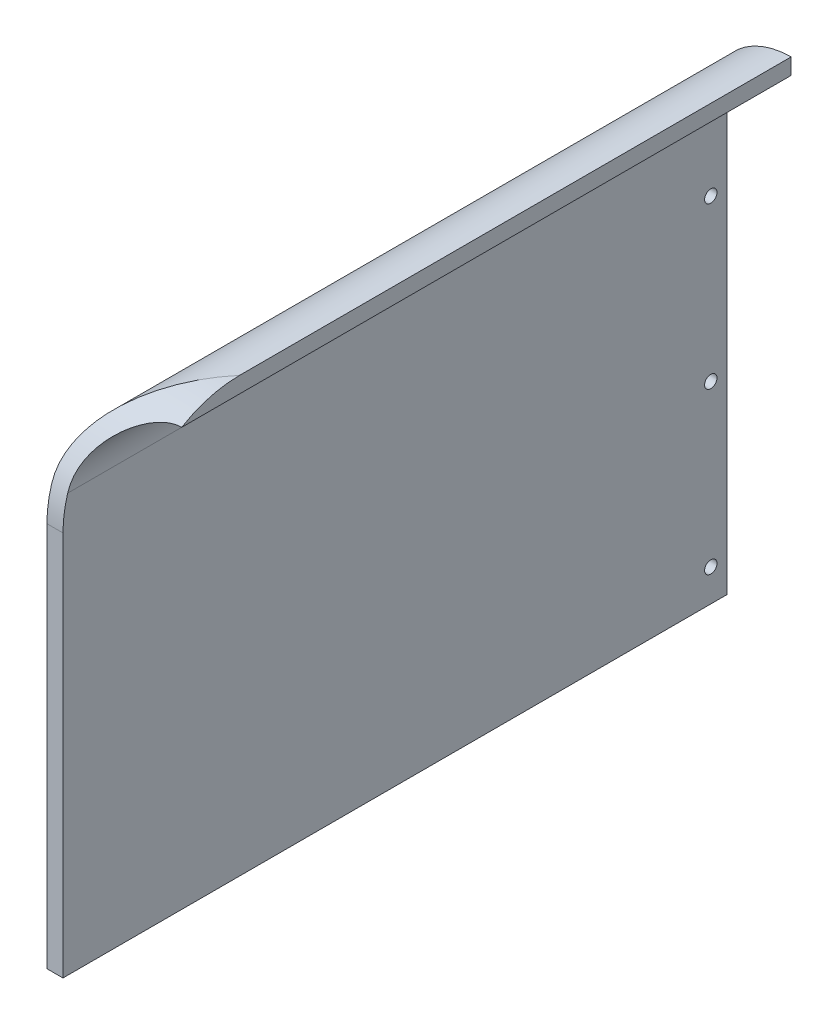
ISO-10303-21;
HEADER;
FILE_DESCRIPTION(('STEP AP214'),'2;1');
FILE_NAME('part.step','',(''),(''),'','','');
FILE_SCHEMA(('AUTOMOTIVE_DESIGN { 1 0 10303 214 1 1 1 1 }'));
ENDSEC;
DATA;
#1=APPLICATION_CONTEXT('core data for automotive mechanical design processes');
#2=APPLICATION_PROTOCOL_DEFINITION('international standard','automotive_design',2000,#1);
#3=PRODUCT_CONTEXT('',#1,'mechanical');
#4=PRODUCT('Part','Part','',(#3));
#5=PRODUCT_RELATED_PRODUCT_CATEGORY('part','',(#4));
#6=PRODUCT_DEFINITION_FORMATION('','',#4);
#7=PRODUCT_DEFINITION_CONTEXT('part definition',#1,'design');
#8=PRODUCT_DEFINITION('design','',#6,#7);
#9=PRODUCT_DEFINITION_SHAPE('','',#8);
#10=(LENGTH_UNIT() NAMED_UNIT(*) SI_UNIT(.MILLI.,.METRE.));
#11=(NAMED_UNIT(*) PLANE_ANGLE_UNIT() SI_UNIT($,.RADIAN.));
#12=(NAMED_UNIT(*) SI_UNIT($,.STERADIAN.) SOLID_ANGLE_UNIT());
#13=UNCERTAINTY_MEASURE_WITH_UNIT(LENGTH_MEASURE(1.E-05),#10,'distance_accuracy_value','');
#14=(GEOMETRIC_REPRESENTATION_CONTEXT(3) GLOBAL_UNCERTAINTY_ASSIGNED_CONTEXT((#13)) GLOBAL_UNIT_ASSIGNED_CONTEXT((#10,
#11,#12)) REPRESENTATION_CONTEXT('',''));
#15=CARTESIAN_POINT('',(0.,0.,0.));
#16=DIRECTION('',(0.,0.,1.));
#17=DIRECTION('',(1.,0.,0.));
#18=AXIS2_PLACEMENT_3D('',#15,#16,#17);
#19=CARTESIAN_POINT('',(12.7,0.,0.));
#20=DIRECTION('',(0.,0.,-1.));
#21=DIRECTION('',(-1.,0.,0.));
#22=AXIS2_PLACEMENT_3D('',#19,#20,#21);
#23=PLANE('',#22);
#24=DIRECTION('',(-1.,0.,0.));
#25=VECTOR('',#24,1.);
#26=CARTESIAN_POINT('',(63.5,304.8,0.));
#27=LINE('',#26,#25);
#28=CARTESIAN_POINT('',(12.6999999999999,304.8,0.));
#29=VERTEX_POINT('',#28);
#30=CARTESIAN_POINT('',(-1.04083408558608E-13,304.8,0.));
#31=VERTEX_POINT('',#30);
#32=EDGE_CURVE('E148',#29,#31,#27,.T.);
#33=ORIENTED_EDGE('',*,*,#32,.T.);
#34=DIRECTION('',(0.,-1.,0.));
#35=VECTOR('',#34,1.);
#36=CARTESIAN_POINT('',(0.,-4.44089209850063E-13,0.));
#37=LINE('',#36,#35);
#38=CARTESIAN_POINT('',(0.,-4.44089209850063E-13,0.));
#39=VERTEX_POINT('',#38);
#40=EDGE_CURVE('E80',#31,#39,#37,.T.);
#41=ORIENTED_EDGE('',*,*,#40,.T.);
#42=DIRECTION('',(-1.,0.,0.));
#43=VECTOR('',#42,1.);
#44=CARTESIAN_POINT('',(12.7,0.,0.));
#45=LINE('',#44,#43);
#46=CARTESIAN_POINT('',(12.7,0.,0.));
#47=VERTEX_POINT('',#46);
#48=EDGE_CURVE('E42',#47,#39,#45,.T.);
#49=ORIENTED_EDGE('',*,*,#48,.F.);
#50=DIRECTION('',(0.,-1.,0.));
#51=VECTOR('',#50,1.);
#52=CARTESIAN_POINT('',(12.7,0.,0.));
#53=LINE('',#52,#51);
#54=EDGE_CURVE('E97',#29,#47,#53,.T.);
#55=ORIENTED_EDGE('',*,*,#54,.F.);
#56=EDGE_LOOP('',(#33,#41,#49,#55));
#57=FACE_BOUND('',#56,.T.);
#58=ADVANCED_FACE('F30',(#57),#23,.F.);
#59=CARTESIAN_POINT('',(12.7,0.,0.));
#60=DIRECTION('',(0.,1.,0.));
#61=DIRECTION('',(0.,0.,1.));
#62=AXIS2_PLACEMENT_3D('',#59,#60,#61);
#63=PLANE('',#62);
#64=DIRECTION('',(0.,0.,-1.));
#65=VECTOR('',#64,1.);
#66=CARTESIAN_POINT('',(0.,-4.44089209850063E-13,0.));
#67=LINE('',#66,#65);
#68=CARTESIAN_POINT('',(0.,0.,-525.018));
#69=VERTEX_POINT('',#68);
#70=EDGE_CURVE('E70',#39,#69,#67,.T.);
#71=ORIENTED_EDGE('',*,*,#70,.T.);
#72=DIRECTION('',(-1.,0.,0.));
#73=VECTOR('',#72,1.);
#74=CARTESIAN_POINT('',(12.6999999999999,0.,-525.018));
#75=LINE('',#74,#73);
#76=CARTESIAN_POINT('',(12.6999999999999,0.,-525.018));
#77=VERTEX_POINT('',#76);
#78=EDGE_CURVE('E73',#77,#69,#75,.T.);
#79=ORIENTED_EDGE('',*,*,#78,.F.);
#80=DIRECTION('',(0.,0.,-1.));
#81=VECTOR('',#80,1.);
#82=CARTESIAN_POINT('',(12.7,0.,0.));
#83=LINE('',#82,#81);
#84=EDGE_CURVE('E57',#47,#77,#83,.T.);
#85=ORIENTED_EDGE('',*,*,#84,.F.);
#86=ORIENTED_EDGE('',*,*,#48,.T.);
#87=EDGE_LOOP('',(#71,#79,#85,#86));
#88=FACE_BOUND('',#87,.T.);
#89=ADVANCED_FACE('F72',(#88),#63,.F.);
#90=CARTESIAN_POINT('',(12.6999999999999,0.,-525.018));
#91=DIRECTION('',(0.,0.,1.));
#92=DIRECTION('',(1.,0.,0.));
#93=AXIS2_PLACEMENT_3D('',#90,#91,#92);
#94=PLANE('',#93);
#95=DIRECTION('',(0.,1.,0.));
#96=VECTOR('',#95,1.);
#97=CARTESIAN_POINT('',(0.,0.,-525.018));
#98=LINE('',#97,#96);
#99=CARTESIAN_POINT('',(0.,330.2,-525.018));
#100=VERTEX_POINT('',#99);
#101=EDGE_CURVE('E79',#69,#100,#98,.T.);
#102=ORIENTED_EDGE('',*,*,#101,.T.);
#103=CARTESIAN_POINT('',(63.4999999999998,330.2,-525.018));
#104=DIRECTION('',(0.,0.,-1.));
#105=DIRECTION('',(1.,0.,0.));
#106=AXIS2_PLACEMENT_3D('',#103,#104,#105);
#107=CIRCLE('',#106,63.5);
#108=CARTESIAN_POINT('',(63.4999999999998,393.699999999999,-525.018));
#109=VERTEX_POINT('',#108);
#110=EDGE_CURVE('E137',#100,#109,#107,.T.);
#111=ORIENTED_EDGE('',*,*,#110,.T.);
#112=DIRECTION('',(0.,-1.,0.));
#113=VECTOR('',#112,1.);
#114=CARTESIAN_POINT('',(63.4999999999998,381.,-525.018));
#115=LINE('',#114,#113);
#116=CARTESIAN_POINT('',(63.4999999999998,381.,-525.018));
#117=VERTEX_POINT('',#116);
#118=EDGE_CURVE('E134',#109,#117,#115,.T.);
#119=ORIENTED_EDGE('',*,*,#118,.T.);
#120=CARTESIAN_POINT('',(63.4999999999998,330.2,-525.018));
#121=DIRECTION('',(0.,0.,1.));
#122=DIRECTION('',(1.,0.,0.));
#123=AXIS2_PLACEMENT_3D('',#120,#121,#122);
#124=CIRCLE('',#123,50.8);
#125=CARTESIAN_POINT('',(12.7,330.2,-525.018));
#126=VERTEX_POINT('',#125);
#127=EDGE_CURVE('E125',#117,#126,#124,.T.);
#128=ORIENTED_EDGE('',*,*,#127,.T.);
#129=DIRECTION('',(0.,1.,0.));
#130=VECTOR('',#129,1.);
#131=CARTESIAN_POINT('',(12.6999999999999,0.,-525.018));
#132=LINE('',#131,#130);
#133=EDGE_CURVE('E89',#77,#126,#132,.T.);
#134=ORIENTED_EDGE('',*,*,#133,.F.);
#135=ORIENTED_EDGE('',*,*,#78,.T.);
#136=EDGE_LOOP('',(#102,#111,#119,#128,#134,#135));
#137=FACE_BOUND('',#136,.T.);
#138=ADVANCED_FACE('F84',(#137),#94,.F.);
#139=CARTESIAN_POINT('',(12.6999999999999,304.8,0.));
#140=DIRECTION('',(-1.,0.,0.));
#141=DIRECTION('',(0.,0.,1.));
#142=AXIS2_PLACEMENT_3D('',#139,#140,#141);
#143=PLANE('',#142);
#144=CARTESIAN_POINT('',(12.7,152.4,-512.318));
#145=DIRECTION('',(-1.,0.,0.));
#146=DIRECTION('',(0.,0.,1.));
#147=AXIS2_PLACEMENT_3D('',#144,#145,#146);
#148=CIRCLE('',#147,4.90219999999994);
#149=CARTESIAN_POINT('',(12.7,152.4,-507.4158));
#150=VERTEX_POINT('',#149);
#151=EDGE_CURVE('E114',#150,#150,#148,.T.);
#152=ORIENTED_EDGE('',*,*,#151,.T.);
#153=EDGE_LOOP('',(#152));
#154=FACE_BOUND('',#153,.T.);
#155=CARTESIAN_POINT('',(12.6999999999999,279.4,-512.318));
#156=DIRECTION('',(-1.,0.,0.));
#157=DIRECTION('',(0.,0.,1.));
#158=AXIS2_PLACEMENT_3D('',#155,#156,#157);
#159=CIRCLE('',#158,4.90219999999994);
#160=CARTESIAN_POINT('',(12.6999999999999,279.4,-507.4158));
#161=VERTEX_POINT('',#160);
#162=EDGE_CURVE('E108',#161,#161,#159,.T.);
#163=ORIENTED_EDGE('',*,*,#162,.T.);
#164=EDGE_LOOP('',(#163));
#165=FACE_BOUND('',#164,.T.);
#166=CARTESIAN_POINT('',(12.6999999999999,25.3999999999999,-512.318));
#167=DIRECTION('',(-1.,0.,0.));
#168=DIRECTION('',(0.,0.,1.));
#169=AXIS2_PLACEMENT_3D('',#166,#167,#168);
#170=CIRCLE('',#169,4.90219999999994);
#171=CARTESIAN_POINT('',(12.6999999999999,25.3999999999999,-507.4158));
#172=VERTEX_POINT('',#171);
#173=EDGE_CURVE('E102',#172,#172,#170,.T.);
#174=ORIENTED_EDGE('',*,*,#173,.T.);
#175=EDGE_LOOP('',(#174));
#176=FACE_BOUND('',#175,.T.);
#177=DIRECTION('',(0.,0.,-1.));
#178=VECTOR('',#177,1.);
#179=CARTESIAN_POINT('',(12.7,330.2,109.249530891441));
#180=LINE('',#179,#178);
#181=CARTESIAN_POINT('',(12.7,330.2,-3.70581005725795));
#182=VERTEX_POINT('',#181);
#183=EDGE_CURVE('E120',#182,#126,#180,.T.);
#184=ORIENTED_EDGE('',*,*,#183,.F.);
#185=CARTESIAN_POINT('',(12.6999999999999,304.8,-88.8999999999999));
#186=DIRECTION('',(-1.,0.,0.));
#187=DIRECTION('',(0.,0.,1.));
#188=AXIS2_PLACEMENT_3D('',#185,#186,#187);
#189=CIRCLE('',#188,88.9);
#190=EDGE_CURVE('E139',#182,#29,#189,.F.);
#191=ORIENTED_EDGE('',*,*,#190,.T.);
#192=ORIENTED_EDGE('',*,*,#54,.T.);
#193=ORIENTED_EDGE('',*,*,#84,.T.);
#194=ORIENTED_EDGE('',*,*,#133,.T.);
#195=EDGE_LOOP('',(#184,#191,#192,#193,#194));
#196=FACE_BOUND('',#195,.T.);
#197=ADVANCED_FACE('F194',(#154,#165,#176,#196),#143,.F.);
#198=CARTESIAN_POINT('',(-1.04083408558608E-13,304.8,0.));
#199=DIRECTION('',(-1.,0.,0.));
#200=DIRECTION('',(0.,0.,1.));
#201=AXIS2_PLACEMENT_3D('',#198,#199,#200);
#202=PLANE('',#201);
#203=CARTESIAN_POINT('',(-1.11022302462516E-13,304.8,-88.8999999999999));
#204=DIRECTION('',(1.,0.,0.));
#205=DIRECTION('',(0.,0.,1.));
#206=AXIS2_PLACEMENT_3D('',#203,#204,#205);
#207=CIRCLE('',#206,88.9);
#208=CARTESIAN_POINT('',(0.,330.2,-3.70581005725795));
#209=VERTEX_POINT('',#208);
#210=EDGE_CURVE('E177',#209,#31,#207,.T.);
#211=ORIENTED_EDGE('',*,*,#210,.F.);
#212=DIRECTION('',(0.,0.,-1.));
#213=VECTOR('',#212,1.);
#214=CARTESIAN_POINT('',(1.11022302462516E-13,330.2,109.249530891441));
#215=LINE('',#214,#213);
#216=EDGE_CURVE('E96',#209,#100,#215,.T.);
#217=ORIENTED_EDGE('',*,*,#216,.T.);
#218=ORIENTED_EDGE('',*,*,#101,.F.);
#219=ORIENTED_EDGE('',*,*,#70,.F.);
#220=ORIENTED_EDGE('',*,*,#40,.F.);
#221=EDGE_LOOP('',(#211,#217,#218,#219,#220));
#222=FACE_BOUND('',#221,.T.);
#223=CARTESIAN_POINT('',(0.,152.4,-512.318));
#224=DIRECTION('',(-1.,0.,0.));
#225=DIRECTION('',(0.,0.,1.));
#226=AXIS2_PLACEMENT_3D('',#223,#224,#225);
#227=CIRCLE('',#226,4.90219999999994);
#228=CARTESIAN_POINT('',(0.,152.4,-507.4158));
#229=VERTEX_POINT('',#228);
#230=EDGE_CURVE('E117',#229,#229,#227,.T.);
#231=ORIENTED_EDGE('',*,*,#230,.F.);
#232=EDGE_LOOP('',(#231));
#233=FACE_BOUND('',#232,.T.);
#234=CARTESIAN_POINT('',(-1.17961196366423E-13,279.4,-512.318));
#235=DIRECTION('',(-1.,0.,0.));
#236=DIRECTION('',(0.,0.,1.));
#237=AXIS2_PLACEMENT_3D('',#234,#235,#236);
#238=CIRCLE('',#237,4.90219999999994);
#239=CARTESIAN_POINT('',(-1.17961196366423E-13,279.4,-507.4158));
#240=VERTEX_POINT('',#239);
#241=EDGE_CURVE('E111',#240,#240,#238,.T.);
#242=ORIENTED_EDGE('',*,*,#241,.F.);
#243=EDGE_LOOP('',(#242));
#244=FACE_BOUND('',#243,.T.);
#245=CARTESIAN_POINT('',(0.,25.3999999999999,-512.318));
#246=DIRECTION('',(-1.,0.,0.));
#247=DIRECTION('',(0.,0.,1.));
#248=AXIS2_PLACEMENT_3D('',#245,#246,#247);
#249=CIRCLE('',#248,4.90219999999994);
#250=CARTESIAN_POINT('',(0.,25.3999999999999,-507.4158));
#251=VERTEX_POINT('',#250);
#252=EDGE_CURVE('E105',#251,#251,#249,.T.);
#253=ORIENTED_EDGE('',*,*,#252,.F.);
#254=EDGE_LOOP('',(#253));
#255=FACE_BOUND('',#254,.T.);
#256=ADVANCED_FACE('F93',(#222,#233,#244,#255),#202,.T.);
#257=CARTESIAN_POINT('',(12.6999999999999,25.3999999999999,-512.318));
#258=DIRECTION('',(-1.,0.,0.));
#259=DIRECTION('',(0.,0.,1.));
#260=AXIS2_PLACEMENT_3D('',#257,#258,#259);
#261=CYLINDRICAL_SURFACE('',#260,4.90219999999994);
#262=ORIENTED_EDGE('',*,*,#173,.F.);
#263=EDGE_LOOP('',(#262));
#264=FACE_BOUND('',#263,.T.);
#265=ORIENTED_EDGE('',*,*,#252,.T.);
#266=EDGE_LOOP('',(#265));
#267=FACE_BOUND('',#266,.T.);
#268=ADVANCED_FACE('F202',(#264,#267),#261,.F.);
#269=CARTESIAN_POINT('',(12.6999999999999,279.4,-512.318));
#270=DIRECTION('',(-1.,0.,0.));
#271=DIRECTION('',(0.,0.,1.));
#272=AXIS2_PLACEMENT_3D('',#269,#270,#271);
#273=CYLINDRICAL_SURFACE('',#272,4.90219999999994);
#274=ORIENTED_EDGE('',*,*,#162,.F.);
#275=EDGE_LOOP('',(#274));
#276=FACE_BOUND('',#275,.T.);
#277=ORIENTED_EDGE('',*,*,#241,.T.);
#278=EDGE_LOOP('',(#277));
#279=FACE_BOUND('',#278,.T.);
#280=ADVANCED_FACE('F209',(#276,#279),#273,.F.);
#281=CARTESIAN_POINT('',(12.7,152.4,-512.318));
#282=DIRECTION('',(-1.,0.,0.));
#283=DIRECTION('',(0.,0.,1.));
#284=AXIS2_PLACEMENT_3D('',#281,#282,#283);
#285=CYLINDRICAL_SURFACE('',#284,4.90219999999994);
#286=ORIENTED_EDGE('',*,*,#151,.F.);
#287=EDGE_LOOP('',(#286));
#288=FACE_BOUND('',#287,.T.);
#289=ORIENTED_EDGE('',*,*,#230,.T.);
#290=EDGE_LOOP('',(#289));
#291=FACE_BOUND('',#290,.T.);
#292=ADVANCED_FACE('F213',(#288,#291),#285,.F.);
#293=CARTESIAN_POINT('',(63.5,330.2,109.249530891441));
#294=DIRECTION('',(0.,0.,-1.));
#295=DIRECTION('',(-1.,0.,0.));
#296=AXIS2_PLACEMENT_3D('',#293,#294,#295);
#297=CYLINDRICAL_SURFACE('',#296,50.8);
#298=CARTESIAN_POINT('',(12.7,330.2,-3.70581005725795));
#299=CARTESIAN_POINT('',(12.699983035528,330.925759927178,-3.92216532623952));
#300=CARTESIAN_POINT('',(12.7155519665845,331.648705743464,-4.14782788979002));
#301=CARTESIAN_POINT('',(12.7770166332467,333.087348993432,-4.61710039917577));
#302=CARTESIAN_POINT('',(12.8229083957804,333.803047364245,-4.86070799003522));
#303=CARTESIAN_POINT('',(12.9441065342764,335.224972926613,-5.36497892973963));
#304=CARTESIAN_POINT('',(13.0193800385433,335.931209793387,-5.62562294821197));
#305=CARTESIAN_POINT('',(13.198409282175,337.333704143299,-6.16347761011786));
#306=CARTESIAN_POINT('',(13.3021658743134,338.029961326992,-6.44068874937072));
#307=CARTESIAN_POINT('',(13.5362432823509,339.40575854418,-7.00860347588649));
#308=CARTESIAN_POINT('',(13.6663449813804,340.085387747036,-7.29918140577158));
#309=CARTESIAN_POINT('',(13.952623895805,341.432629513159,-7.89504134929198));
#310=CARTESIAN_POINT('',(14.1088039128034,342.100240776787,-8.20032494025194));
#311=CARTESIAN_POINT('',(14.6150224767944,344.083837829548,-9.1370566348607));
#312=CARTESIAN_POINT('',(15.0027429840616,345.380606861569,-9.78939393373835));
#313=CARTESIAN_POINT('',(15.8684881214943,347.910422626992,-11.1391567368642));
#314=CARTESIAN_POINT('',(16.3460829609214,349.143738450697,-11.8363576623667));
#315=CARTESIAN_POINT('',(17.3853829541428,351.549443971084,-13.2715596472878));
#316=CARTESIAN_POINT('',(17.9470823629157,352.721837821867,-14.0095579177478));
#317=CARTESIAN_POINT('',(19.1493906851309,355.005911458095,-15.5211437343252));
#318=CARTESIAN_POINT('',(19.7901802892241,356.117443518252,-16.2948101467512));
#319=CARTESIAN_POINT('',(21.1439666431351,358.275416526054,-17.8692038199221));
#320=CARTESIAN_POINT('',(21.8569681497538,359.321853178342,-18.6699328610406));
#321=CARTESIAN_POINT('',(23.4833403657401,361.528994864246,-20.4356478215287));
#322=CARTESIAN_POINT('',(24.4097987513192,362.676945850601,-21.4045299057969));
#323=CARTESIAN_POINT('',(26.3512085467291,364.880898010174,-23.3586816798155));
#324=CARTESIAN_POINT('',(27.3661760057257,365.936882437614,-24.3439543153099));
#325=CARTESIAN_POINT('',(28.9525644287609,367.451159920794,-25.8243209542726));
#326=CARTESIAN_POINT('',(29.4921175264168,367.944383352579,-26.3182734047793));
#327=CARTESIAN_POINT('',(30.592476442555,368.907486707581,-27.3052329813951));
#328=CARTESIAN_POINT('',(31.1532808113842,369.37736821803,-27.7982401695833));
#329=CARTESIAN_POINT('',(32.2960910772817,370.293544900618,-28.781309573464));
#330=CARTESIAN_POINT('',(32.8780931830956,370.739844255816,-29.2713722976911));
#331=CARTESIAN_POINT('',(34.0635903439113,371.608667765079,-30.2464542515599));
#332=CARTESIAN_POINT('',(34.6670844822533,372.031192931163,-30.731473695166));
#333=CARTESIAN_POINT('',(36.2133299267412,373.064132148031,-31.942669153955));
#334=CARTESIAN_POINT('',(37.1703718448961,373.65892511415,-32.6640674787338));
#335=CARTESIAN_POINT('',(39.1371859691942,374.791266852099,-34.0798017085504));
#336=CARTESIAN_POINT('',(40.1469625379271,375.328810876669,-34.7741353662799));
#337=CARTESIAN_POINT('',(42.2212401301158,376.343105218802,-36.1221198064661));
#338=CARTESIAN_POINT('',(43.2856858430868,376.819915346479,-36.7758102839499));
#339=CARTESIAN_POINT('',(45.4733689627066,377.708667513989,-38.0263942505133));
#340=CARTESIAN_POINT('',(46.5965790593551,378.120639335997,-38.6233137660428));
#341=CARTESIAN_POINT('',(48.5168670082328,378.746836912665,-39.5514856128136));
#342=CARTESIAN_POINT('',(49.2968663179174,378.981022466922,-39.90465870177));
#343=CARTESIAN_POINT('',(50.8840955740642,379.415401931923,-40.5687566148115));
#344=CARTESIAN_POINT('',(51.6913259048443,379.615595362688,-40.8796808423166));
#345=CARTESIAN_POINT('',(53.3287493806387,379.978370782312,-41.4496424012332));
#346=CARTESIAN_POINT('',(54.1588454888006,380.141090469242,-41.7088692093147));
#347=CARTESIAN_POINT('',(55.8419348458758,380.426701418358,-42.167939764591));
#348=CARTESIAN_POINT('',(56.6949173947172,380.549610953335,-42.3678107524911));
#349=CARTESIAN_POINT('',(58.0428362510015,380.708407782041,-42.6275944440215));
#350=CARTESIAN_POINT('',(58.5317310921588,380.758872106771,-42.7105341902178));
#351=CARTESIAN_POINT('',(59.5140033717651,380.845777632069,-42.8537544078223));
#352=CARTESIAN_POINT('',(60.0073798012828,380.882221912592,-42.9140398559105));
#353=CARTESIAN_POINT('',(60.999695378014,380.940876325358,-43.0112173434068));
#354=CARTESIAN_POINT('',(61.4986498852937,380.963016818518,-43.0479949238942));
#355=CARTESIAN_POINT('',(62.4983927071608,380.992594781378,-43.097176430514));
#356=CARTESIAN_POINT('',(62.9991816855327,381.000026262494,-43.1095704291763));
#357=CARTESIAN_POINT('',(63.4999999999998,381.,-43.1094988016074));
#358=B_SPLINE_CURVE_WITH_KNOTS('',3,(#298,#299,#300,#301,#302,#303,#304,#305,#306,#307,#308,
#309,#310,#311,#312,#313,#314,#315,#316,#317,#318,#319,#320,#321,#322,#323,#324,#325,#326,#327,
#328,#329,#330,#331,#332,#333,#334,#335,#336,#337,#338,#339,#340,#341,#342,#343,#344,#345,#346,
#347,#348,#349,#350,#351,#352,#353,#354,#355,#356,#357),.UNSPECIFIED.,.F.,.F.,(4,2,2,2,2,2,2,2,
2,2,2,2,2,2,2,2,2,2,2,2,2,2,2,2,2,2,2,2,2,4),(0.,2.27168900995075,4.54308042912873,
6.81193791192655,9.08086333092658,11.331640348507,13.5826593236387,18.0846317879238,
22.565598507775,27.0462592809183,31.5373529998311,36.0287427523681,41.3185296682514,
46.6092777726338,49.2555849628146,51.9017119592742,54.5473679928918,57.1929113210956,
61.2043210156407,65.2160630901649,69.2238233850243,73.2297373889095,75.8910387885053,
78.552377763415,81.2037757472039,83.8539550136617,85.3486488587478,86.8430141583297,
88.344601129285,89.8467993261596),.UNSPECIFIED.);
#359=CARTESIAN_POINT('',(63.4999999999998,381.,-43.1094988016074));
#360=VERTEX_POINT('',#359);
#361=EDGE_CURVE('E142',#182,#360,#358,.T.);
#362=ORIENTED_EDGE('',*,*,#361,.F.);
#363=ORIENTED_EDGE('',*,*,#183,.T.);
#364=ORIENTED_EDGE('',*,*,#127,.F.);
#365=DIRECTION('',(0.,0.,-1.));
#366=VECTOR('',#365,1.);
#367=CARTESIAN_POINT('',(63.5,381.,109.249530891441));
#368=LINE('',#367,#366);
#369=EDGE_CURVE('E128',#360,#117,#368,.T.);
#370=ORIENTED_EDGE('',*,*,#369,.F.);
#371=EDGE_LOOP('',(#362,#363,#364,#370));
#372=FACE_BOUND('',#371,.T.);
#373=ADVANCED_FACE('F150',(#372),#297,.F.);
#374=CARTESIAN_POINT('',(63.5,381.,109.249530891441));
#375=DIRECTION('',(1.,0.,0.));
#376=DIRECTION('',(0.,0.,-1.));
#377=AXIS2_PLACEMENT_3D('',#374,#375,#376);
#378=PLANE('',#377);
#379=CARTESIAN_POINT('',(63.5,304.8,-88.9));
#380=DIRECTION('',(1.,0.,0.));
#381=DIRECTION('',(0.,0.,1.));
#382=AXIS2_PLACEMENT_3D('',#379,#380,#381);
#383=CIRCLE('',#382,88.9);
#384=CARTESIAN_POINT('',(63.4999999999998,393.7,-88.9));
#385=VERTEX_POINT('',#384);
#386=EDGE_CURVE('E48',#385,#360,#383,.T.);
#387=ORIENTED_EDGE('',*,*,#386,.T.);
#388=ORIENTED_EDGE('',*,*,#369,.T.);
#389=ORIENTED_EDGE('',*,*,#118,.F.);
#390=DIRECTION('',(0.,0.,-1.));
#391=VECTOR('',#390,1.);
#392=CARTESIAN_POINT('',(63.5,393.699999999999,109.249530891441));
#393=LINE('',#392,#391);
#394=EDGE_CURVE('E124',#385,#109,#393,.T.);
#395=ORIENTED_EDGE('',*,*,#394,.F.);
#396=EDGE_LOOP('',(#387,#388,#389,#395));
#397=FACE_BOUND('',#396,.T.);
#398=ADVANCED_FACE('F161',(#397),#378,.T.);
#399=CARTESIAN_POINT('',(63.5,330.2,109.249530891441));
#400=DIRECTION('',(0.,0.,-1.));
#401=DIRECTION('',(-1.,0.,0.));
#402=AXIS2_PLACEMENT_3D('',#399,#400,#401);
#403=CYLINDRICAL_SURFACE('',#402,63.5);
#404=CARTESIAN_POINT('',(0.,330.2,-3.70581005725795));
#405=CARTESIAN_POINT('',(-2.43644772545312E-05,331.064612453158,-3.96355492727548));
#406=CARTESIAN_POINT('',(0.0176574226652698,331.925235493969,-4.23450634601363));
#407=CARTESIAN_POINT('',(0.0872807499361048,333.636477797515,-4.80197080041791));
#408=CARTESIAN_POINT('',(0.139217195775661,334.487098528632,-5.09848002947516));
#409=CARTESIAN_POINT('',(0.276109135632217,336.17547389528,-5.7158851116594));
#410=CARTESIAN_POINT('',(0.361021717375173,337.013243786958,-6.03674883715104));
#411=CARTESIAN_POINT('',(0.562585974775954,338.675422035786,-6.70226773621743));
#412=CARTESIAN_POINT('',(0.679238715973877,339.499829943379,-7.04692370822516));
#413=CARTESIAN_POINT('',(0.941697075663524,341.126151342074,-7.75568351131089));
#414=CARTESIAN_POINT('',(1.08721929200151,341.928203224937,-8.11957485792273));
#415=CARTESIAN_POINT('',(1.40671630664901,343.516555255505,-8.86869481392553));
#416=CARTESIAN_POINT('',(1.58069427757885,344.302853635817,-9.25392579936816));
#417=CARTESIAN_POINT('',(2.14330900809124,346.636760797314,-10.4402022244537));
#418=CARTESIAN_POINT('',(2.57262014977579,348.15934243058,-11.271814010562));
#419=CARTESIAN_POINT('',(3.52573158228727,351.122420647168,-13.0028739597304));
#420=CARTESIAN_POINT('',(4.04901584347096,352.563311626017,-13.901936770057));
#421=CARTESIAN_POINT('',(5.18096908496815,355.367978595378,-15.7636736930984));
#422=CARTESIAN_POINT('',(5.7896293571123,356.731762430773,-16.7263413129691));
#423=CARTESIAN_POINT('',(7.08412800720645,359.383592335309,-18.7103234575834));
#424=CARTESIAN_POINT('',(7.77015795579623,360.671437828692,-19.731780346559));
#425=CARTESIAN_POINT('',(9.20908180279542,363.166975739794,-21.82422945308));
#426=CARTESIAN_POINT('',(9.96198638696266,364.374655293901,-22.8952295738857));
#427=CARTESIAN_POINT('',(11.9883776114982,367.39944331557,-25.7257512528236));
#428=CARTESIAN_POINT('',(13.3069103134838,369.155696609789,-27.5186676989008));
#429=CARTESIAN_POINT('',(15.3744649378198,371.640864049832,-30.2737186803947));
#430=CARTESIAN_POINT('',(16.0788666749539,372.444635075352,-31.2033459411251));
#431=CARTESIAN_POINT('',(17.5147585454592,374.003311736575,-33.0824282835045));
#432=CARTESIAN_POINT('',(18.2462479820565,374.758218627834,-34.0318828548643));
#433=CARTESIAN_POINT('',(20.4801731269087,376.953728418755,-36.9107420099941));
#434=CARTESIAN_POINT('',(22.0195273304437,378.322099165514,-38.8672716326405));
#435=CARTESIAN_POINT('',(24.3868089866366,380.234360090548,-41.8440910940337));
#436=CARTESIAN_POINT('',(25.1856717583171,380.848437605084,-42.8434429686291));
#437=CARTESIAN_POINT('',(26.8009960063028,382.030828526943,-44.854911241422));
#438=CARTESIAN_POINT('',(27.6174564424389,382.599144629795,-45.8670268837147));
#439=CARTESIAN_POINT('',(29.5596146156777,383.885173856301,-48.2650589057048));
#440=CARTESIAN_POINT('',(30.6919122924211,384.584033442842,-49.6557595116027));
#441=CARTESIAN_POINT('',(32.9812194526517,385.900968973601,-52.4550338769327));
#442=CARTESIAN_POINT('',(34.1382307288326,386.519039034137,-53.863608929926));
#443=CARTESIAN_POINT('',(36.4736284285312,387.676292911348,-56.6963977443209));
#444=CARTESIAN_POINT('',(37.6520234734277,388.215444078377,-58.1206177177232));
#445=CARTESIAN_POINT('',(40.0262912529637,389.216053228,-60.9816096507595));
#446=CARTESIAN_POINT('',(41.2221635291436,389.677513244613,-62.4183812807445));
#447=CARTESIAN_POINT('',(43.6264280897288,390.523399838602,-65.3000007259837));
#448=CARTESIAN_POINT('',(44.8347976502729,390.907946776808,-66.7448322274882));
#449=CARTESIAN_POINT('',(47.2631110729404,391.60202015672,-69.6428104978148));
#450=CARTESIAN_POINT('',(48.4830552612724,391.911544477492,-71.0959575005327));
#451=CARTESIAN_POINT('',(50.9311483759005,392.456289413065,-74.007800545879));
#452=CARTESIAN_POINT('',(52.1592923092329,392.691551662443,-75.4664930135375));
#453=CARTESIAN_POINT('',(54.6218725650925,393.088664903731,-78.3883343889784));
#454=CARTESIAN_POINT('',(55.856308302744,393.250522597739,-79.8514828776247));
#455=CARTESIAN_POINT('',(58.1525281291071,393.483404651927,-82.5713947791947));
#456=CARTESIAN_POINT('',(59.2137887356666,393.564100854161,-83.8277869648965));
#457=CARTESIAN_POINT('',(61.3372266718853,393.672055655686,-86.3409679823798));
#458=CARTESIAN_POINT('',(62.3994031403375,393.699344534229,-87.5977561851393));
#459=CARTESIAN_POINT('',(63.4743383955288,393.699996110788,-88.8696367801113));
#460=CARTESIAN_POINT('',(63.4871692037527,393.699999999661,-88.8848183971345));
#461=CARTESIAN_POINT('',(63.4999999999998,393.7,-88.9));
#462=B_SPLINE_CURVE_WITH_KNOTS('',3,(#404,#405,#406,#407,#408,#409,#410,#411,#412,#413,#414,
#415,#416,#417,#418,#419,#420,#421,#422,#423,#424,#425,#426,#427,#428,#429,#430,#431,#432,#433,
#434,#435,#436,#437,#438,#439,#440,#441,#442,#443,#444,#445,#446,#447,#448,#449,#450,#451,#452,
#453,#454,#455,#456,#457,#458,#459,#460,#461),.UNSPECIFIED.,.F.,.F.,(4,2,2,2,2,2,2,2,2,2,2,2,2,
2,2,2,2,2,2,2,2,2,2,2,2,2,2,2,4),(0.,2.70628472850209,5.41216707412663,8.11453995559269,
10.8170035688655,13.4941452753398,16.1715856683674,21.5265957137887,26.8530524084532,
32.1789662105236,37.5183693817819,42.858627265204,51.3498008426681,55.5983096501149,
59.8467092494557,68.3590314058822,72.6158145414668,76.8723467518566,82.6444173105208,
88.416907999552,94.1917801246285,99.9665010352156,105.732113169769,111.497888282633,
117.260425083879,123.022435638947,127.961447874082,132.897659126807,132.957291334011),.UNSPECIFIED.);
#463=EDGE_CURVE('E11',#385,#209,#462,.F.);
#464=ORIENTED_EDGE('',*,*,#463,.F.);
#465=ORIENTED_EDGE('',*,*,#394,.T.);
#466=ORIENTED_EDGE('',*,*,#110,.F.);
#467=ORIENTED_EDGE('',*,*,#216,.F.);
#468=EDGE_LOOP('',(#464,#465,#466,#467));
#469=FACE_BOUND('',#468,.T.);
#470=ADVANCED_FACE('F156',(#469),#403,.T.);
#471=CARTESIAN_POINT('',(63.5,304.8,-88.9));
#472=DIRECTION('',(-1.,0.,0.));
#473=DIRECTION('',(0.,0.,1.));
#474=AXIS2_PLACEMENT_3D('',#471,#472,#473);
#475=CYLINDRICAL_SURFACE('',#474,88.9);
#476=ORIENTED_EDGE('',*,*,#361,.T.);
#477=ORIENTED_EDGE('',*,*,#386,.F.);
#478=ORIENTED_EDGE('',*,*,#463,.T.);
#479=ORIENTED_EDGE('',*,*,#210,.T.);
#480=ORIENTED_EDGE('',*,*,#32,.F.);
#481=ORIENTED_EDGE('',*,*,#190,.F.);
#482=EDGE_LOOP('',(#476,#477,#478,#479,#480,#481));
#483=FACE_BOUND('',#482,.T.);
#484=ADVANCED_FACE('F153',(#483),#475,.T.);
#485=CLOSED_SHELL('',(#58,#89,#138,#197,#256,#268,#280,#292,#373,#398,#470,#484));
#486=MANIFOLD_SOLID_BREP('B2',#485);
#487=ADVANCED_BREP_SHAPE_REPRESENTATION('',(#18,#486),#14);
#488=SHAPE_DEFINITION_REPRESENTATION(#9,#487);
ENDSEC;
END-ISO-10303-21;
